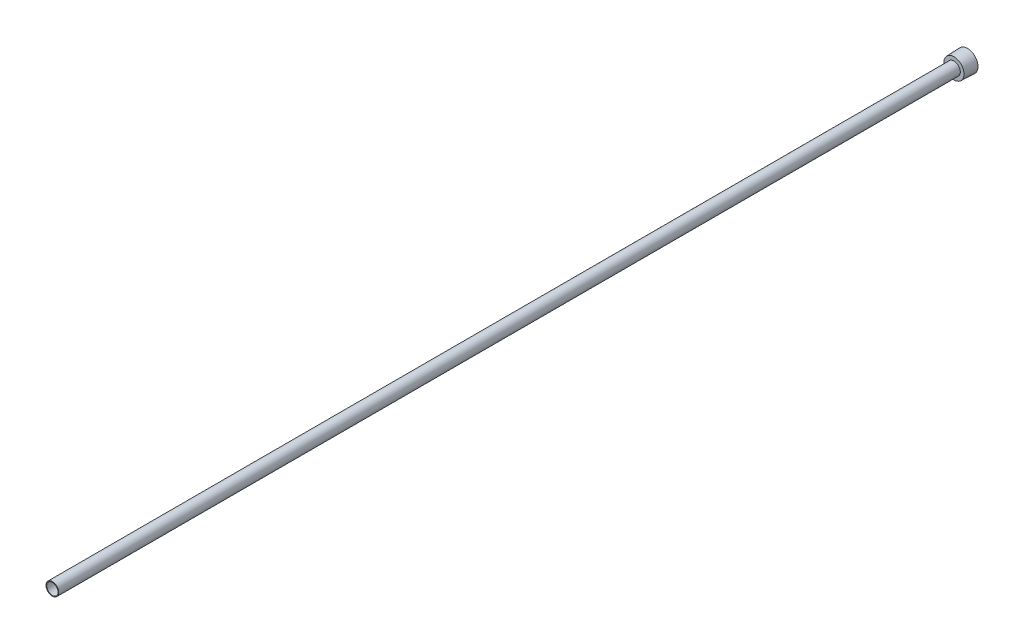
ISO-10303-21;
HEADER;
FILE_DESCRIPTION(('STEP AP214'),'2;1');
FILE_NAME('part.step','',(''),(''),'','','');
FILE_SCHEMA(('AUTOMOTIVE_DESIGN { 1 0 10303 214 1 1 1 1 }'));
ENDSEC;
DATA;
#1=APPLICATION_CONTEXT('core data for automotive mechanical design processes');
#2=APPLICATION_PROTOCOL_DEFINITION('international standard','automotive_design',2000,#1);
#3=PRODUCT_CONTEXT('',#1,'mechanical');
#4=PRODUCT('Part','Part','',(#3));
#5=PRODUCT_RELATED_PRODUCT_CATEGORY('part','',(#4));
#6=PRODUCT_DEFINITION_FORMATION('','',#4);
#7=PRODUCT_DEFINITION_CONTEXT('part definition',#1,'design');
#8=PRODUCT_DEFINITION('design','',#6,#7);
#9=PRODUCT_DEFINITION_SHAPE('','',#8);
#10=(LENGTH_UNIT() NAMED_UNIT(*) SI_UNIT(.MILLI.,.METRE.));
#11=(NAMED_UNIT(*) PLANE_ANGLE_UNIT() SI_UNIT($,.RADIAN.));
#12=(NAMED_UNIT(*) SI_UNIT($,.STERADIAN.) SOLID_ANGLE_UNIT());
#13=UNCERTAINTY_MEASURE_WITH_UNIT(LENGTH_MEASURE(1.E-05),#10,'distance_accuracy_value','');
#14=(GEOMETRIC_REPRESENTATION_CONTEXT(3) GLOBAL_UNCERTAINTY_ASSIGNED_CONTEXT((#13)) GLOBAL_UNIT_ASSIGNED_CONTEXT((#10,
#11,#12)) REPRESENTATION_CONTEXT('',''));
#15=CARTESIAN_POINT('',(0.,0.,0.));
#16=DIRECTION('',(0.,0.,1.));
#17=DIRECTION('',(1.,0.,0.));
#18=AXIS2_PLACEMENT_3D('',#15,#16,#17);
#19=CARTESIAN_POINT('',(0.,0.,0.));
#20=DIRECTION('',(0.,0.,1.));
#21=DIRECTION('',(1.,0.,0.));
#22=AXIS2_PLACEMENT_3D('',#19,#20,#21);
#23=CYLINDRICAL_SURFACE('',#22,5.6388);
#24=CARTESIAN_POINT('',(0.,0.,914.4));
#25=DIRECTION('',(0.,0.,1.));
#26=DIRECTION('',(1.,0.,0.));
#27=AXIS2_PLACEMENT_3D('',#24,#25,#26);
#28=CIRCLE('',#27,5.6388);
#29=CARTESIAN_POINT('',(5.6388,0.,914.4));
#30=VERTEX_POINT('',#29);
#31=EDGE_CURVE('E141',#30,#30,#28,.T.);
#32=ORIENTED_EDGE('',*,*,#31,.T.);
#33=EDGE_LOOP('',(#32));
#34=FACE_BOUND('',#33,.T.);
#35=CARTESIAN_POINT('',(0.,0.,9.525));
#36=DIRECTION('',(0.,0.,-1.));
#37=DIRECTION('',(-1.,0.,0.));
#38=AXIS2_PLACEMENT_3D('',#35,#36,#37);
#39=CIRCLE('',#38,5.6388);
#40=CARTESIAN_POINT('',(-5.6388,0.,9.525));
#41=VERTEX_POINT('',#40);
#42=EDGE_CURVE('E36',#41,#41,#39,.F.);
#43=ORIENTED_EDGE('',*,*,#42,.F.);
#44=EDGE_LOOP('',(#43));
#45=FACE_BOUND('',#44,.T.);
#46=ADVANCED_FACE('F32',(#34,#45),#23,.F.);
#47=CARTESIAN_POINT('',(0.,0.,0.));
#48=DIRECTION('',(0.,0.,1.));
#49=DIRECTION('',(1.,0.,0.));
#50=AXIS2_PLACEMENT_3D('',#47,#48,#49);
#51=PLANE('',#50);
#52=DIRECTION('',(-0.866025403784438,0.5,0.));
#53=VECTOR('',#52,1.);
#54=CARTESIAN_POINT('',(0.,-7.33234841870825,0.));
#55=LINE('',#54,#53);
#56=CARTESIAN_POINT('',(0.,-7.33234841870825,0.));
#57=VERTEX_POINT('',#56);
#58=CARTESIAN_POINT('',(-6.35,-3.66617420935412,0.));
#59=VERTEX_POINT('',#58);
#60=EDGE_CURVE('E123',#57,#59,#55,.T.);
#61=ORIENTED_EDGE('',*,*,#60,.F.);
#62=DIRECTION('',(-0.866025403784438,-0.5,0.));
#63=VECTOR('',#62,1.);
#64=CARTESIAN_POINT('',(6.35,-3.66617420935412,0.));
#65=LINE('',#64,#63);
#66=CARTESIAN_POINT('',(6.35,-3.66617420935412,0.));
#67=VERTEX_POINT('',#66);
#68=EDGE_CURVE('E48',#67,#57,#65,.T.);
#69=ORIENTED_EDGE('',*,*,#68,.F.);
#70=DIRECTION('',(0.,-1.,0.));
#71=VECTOR('',#70,1.);
#72=CARTESIAN_POINT('',(6.35,3.66617420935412,0.));
#73=LINE('',#72,#71);
#74=CARTESIAN_POINT('',(6.35,3.66617420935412,0.));
#75=VERTEX_POINT('',#74);
#76=EDGE_CURVE('E132',#75,#67,#73,.T.);
#77=ORIENTED_EDGE('',*,*,#76,.F.);
#78=DIRECTION('',(0.866025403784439,-0.5,0.));
#79=VECTOR('',#78,1.);
#80=CARTESIAN_POINT('',(0.,7.33234841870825,0.));
#81=LINE('',#80,#79);
#82=CARTESIAN_POINT('',(0.,7.33234841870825,0.));
#83=VERTEX_POINT('',#82);
#84=EDGE_CURVE('E130',#83,#75,#81,.T.);
#85=ORIENTED_EDGE('',*,*,#84,.F.);
#86=DIRECTION('',(0.866025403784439,0.5,0.));
#87=VECTOR('',#86,1.);
#88=CARTESIAN_POINT('',(-6.35,3.66617420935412,0.));
#89=LINE('',#88,#87);
#90=CARTESIAN_POINT('',(-6.35,3.66617420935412,0.));
#91=VERTEX_POINT('',#90);
#92=EDGE_CURVE('E96',#91,#83,#89,.T.);
#93=ORIENTED_EDGE('',*,*,#92,.F.);
#94=DIRECTION('',(0.,1.,0.));
#95=VECTOR('',#94,1.);
#96=CARTESIAN_POINT('',(-6.35,-3.66617420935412,0.));
#97=LINE('',#96,#95);
#98=EDGE_CURVE('E126',#59,#91,#97,.T.);
#99=ORIENTED_EDGE('',*,*,#98,.F.);
#100=EDGE_LOOP('',(#61,#69,#77,#85,#93,#99));
#101=FACE_BOUND('',#100,.T.);
#102=CARTESIAN_POINT('',(0.,0.,0.));
#103=DIRECTION('',(0.,0.,1.));
#104=DIRECTION('',(1.,0.,0.));
#105=AXIS2_PLACEMENT_3D('',#102,#103,#104);
#106=CIRCLE('',#105,10.541);
#107=CARTESIAN_POINT('',(10.541,0.,0.));
#108=VERTEX_POINT('',#107);
#109=EDGE_CURVE('E11',#108,#108,#106,.T.);
#110=ORIENTED_EDGE('',*,*,#109,.F.);
#111=EDGE_LOOP('',(#110));
#112=FACE_BOUND('',#111,.T.);
#113=ADVANCED_FACE('F34',(#101,#112),#51,.F.);
#114=CARTESIAN_POINT('',(0.,0.,0.));
#115=DIRECTION('',(0.,0.,-1.));
#116=DIRECTION('',(-1.,0.,0.));
#117=AXIS2_PLACEMENT_3D('',#114,#115,#116);
#118=CONICAL_SURFACE('',#117,10.541,0.0364599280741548);
#119=CARTESIAN_POINT('',(0.,0.,13.4874));
#120=DIRECTION('',(0.,0.,1.));
#121=DIRECTION('',(1.,0.,0.));
#122=AXIS2_PLACEMENT_3D('',#119,#120,#121);
#123=CIRCLE('',#122,10.0490323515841);
#124=CARTESIAN_POINT('',(10.0490323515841,0.,13.4874));
#125=VERTEX_POINT('',#124);
#126=EDGE_CURVE('E41',#125,#125,#123,.T.);
#127=ORIENTED_EDGE('',*,*,#126,.F.);
#128=EDGE_LOOP('',(#127));
#129=FACE_BOUND('',#128,.T.);
#130=ORIENTED_EDGE('',*,*,#109,.T.);
#131=EDGE_LOOP('',(#130));
#132=FACE_BOUND('',#131,.T.);
#133=ADVANCED_FACE('F155',(#129,#132),#118,.T.);
#134=CARTESIAN_POINT('',(0.,10.0490323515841,13.4874));
#135=DIRECTION('',(0.,0.,-1.));
#136=DIRECTION('',(-1.,0.,0.));
#137=AXIS2_PLACEMENT_3D('',#134,#135,#136);
#138=PLANE('',#137);
#139=CARTESIAN_POINT('',(0.,0.,13.4874));
#140=DIRECTION('',(0.,0.,1.));
#141=DIRECTION('',(1.,0.,0.));
#142=AXIS2_PLACEMENT_3D('',#139,#140,#141);
#143=CIRCLE('',#142,6.35);
#144=CARTESIAN_POINT('',(6.35,0.,13.4874));
#145=VERTEX_POINT('',#144);
#146=EDGE_CURVE('E147',#145,#145,#143,.T.);
#147=ORIENTED_EDGE('',*,*,#146,.F.);
#148=EDGE_LOOP('',(#147));
#149=FACE_BOUND('',#148,.T.);
#150=ORIENTED_EDGE('',*,*,#126,.T.);
#151=EDGE_LOOP('',(#150));
#152=FACE_BOUND('',#151,.T.);
#153=ADVANCED_FACE('F153',(#149,#152),#138,.F.);
#154=CARTESIAN_POINT('',(0.,0.,223.212151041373));
#155=DIRECTION('',(0.,0.,1.));
#156=DIRECTION('',(1.,0.,0.));
#157=AXIS2_PLACEMENT_3D('',#154,#155,#156);
#158=CYLINDRICAL_SURFACE('',#157,6.34999999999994);
#159=CARTESIAN_POINT('',(0.,0.,914.4));
#160=DIRECTION('',(0.,0.,1.));
#161=DIRECTION('',(1.,0.,0.));
#162=AXIS2_PLACEMENT_3D('',#159,#160,#161);
#163=CIRCLE('',#162,6.34999999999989);
#164=CARTESIAN_POINT('',(6.34999999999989,0.,914.4));
#165=VERTEX_POINT('',#164);
#166=EDGE_CURVE('E144',#165,#165,#163,.T.);
#167=ORIENTED_EDGE('',*,*,#166,.F.);
#168=EDGE_LOOP('',(#167));
#169=FACE_BOUND('',#168,.T.);
#170=ORIENTED_EDGE('',*,*,#146,.T.);
#171=EDGE_LOOP('',(#170));
#172=FACE_BOUND('',#171,.T.);
#173=ADVANCED_FACE('F189',(#169,#172),#158,.T.);
#174=CARTESIAN_POINT('',(0.,6.34999999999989,914.4));
#175=DIRECTION('',(0.,0.,-1.));
#176=DIRECTION('',(-1.,0.,0.));
#177=AXIS2_PLACEMENT_3D('',#174,#175,#176);
#178=PLANE('',#177);
#179=ORIENTED_EDGE('',*,*,#31,.F.);
#180=EDGE_LOOP('',(#179));
#181=FACE_BOUND('',#180,.T.);
#182=ORIENTED_EDGE('',*,*,#166,.T.);
#183=EDGE_LOOP('',(#182));
#184=FACE_BOUND('',#183,.T.);
#185=ADVANCED_FACE('F182',(#181,#184),#178,.F.);
#186=CARTESIAN_POINT('',(0.,-7.33234841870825,9.525));
#187=DIRECTION('',(0.,0.,-1.));
#188=DIRECTION('',(-1.,0.,0.));
#189=AXIS2_PLACEMENT_3D('',#186,#187,#188);
#190=PLANE('',#189);
#191=DIRECTION('',(-0.866025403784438,-0.5,0.));
#192=VECTOR('',#191,1.);
#193=CARTESIAN_POINT('',(6.35,-3.66617420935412,9.525));
#194=LINE('',#193,#192);
#195=CARTESIAN_POINT('',(6.35,-3.66617420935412,9.525));
#196=VERTEX_POINT('',#195);
#197=CARTESIAN_POINT('',(0.,-7.33234841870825,9.525));
#198=VERTEX_POINT('',#197);
#199=EDGE_CURVE('E134',#196,#198,#194,.T.);
#200=ORIENTED_EDGE('',*,*,#199,.T.);
#201=DIRECTION('',(-0.866025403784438,0.5,0.));
#202=VECTOR('',#201,1.);
#203=CARTESIAN_POINT('',(0.,-7.33234841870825,9.525));
#204=LINE('',#203,#202);
#205=CARTESIAN_POINT('',(-6.35,-3.66617420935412,9.525));
#206=VERTEX_POINT('',#205);
#207=EDGE_CURVE('E117',#198,#206,#204,.T.);
#208=ORIENTED_EDGE('',*,*,#207,.T.);
#209=DIRECTION('',(0.,1.,0.));
#210=VECTOR('',#209,1.);
#211=CARTESIAN_POINT('',(-6.35,-3.66617420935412,9.525));
#212=LINE('',#211,#210);
#213=CARTESIAN_POINT('',(-6.35,3.66617420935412,9.525));
#214=VERTEX_POINT('',#213);
#215=EDGE_CURVE('E115',#206,#214,#212,.T.);
#216=ORIENTED_EDGE('',*,*,#215,.T.);
#217=DIRECTION('',(0.866025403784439,0.5,0.));
#218=VECTOR('',#217,1.);
#219=CARTESIAN_POINT('',(-6.35,3.66617420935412,9.525));
#220=LINE('',#219,#218);
#221=CARTESIAN_POINT('',(0.,7.33234841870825,9.525));
#222=VERTEX_POINT('',#221);
#223=EDGE_CURVE('E93',#214,#222,#220,.T.);
#224=ORIENTED_EDGE('',*,*,#223,.T.);
#225=DIRECTION('',(0.866025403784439,-0.5,0.));
#226=VECTOR('',#225,1.);
#227=CARTESIAN_POINT('',(0.,7.33234841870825,9.525));
#228=LINE('',#227,#226);
#229=CARTESIAN_POINT('',(6.35,3.66617420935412,9.525));
#230=VERTEX_POINT('',#229);
#231=EDGE_CURVE('E104',#222,#230,#228,.T.);
#232=ORIENTED_EDGE('',*,*,#231,.T.);
#233=DIRECTION('',(0.,-1.,0.));
#234=VECTOR('',#233,1.);
#235=CARTESIAN_POINT('',(6.35,3.66617420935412,9.525));
#236=LINE('',#235,#234);
#237=EDGE_CURVE('E108',#230,#196,#236,.T.);
#238=ORIENTED_EDGE('',*,*,#237,.T.);
#239=EDGE_LOOP('',(#200,#208,#216,#224,#232,#238));
#240=FACE_BOUND('',#239,.T.);
#241=ORIENTED_EDGE('',*,*,#42,.T.);
#242=EDGE_LOOP('',(#241));
#243=FACE_BOUND('',#242,.T.);
#244=ADVANCED_FACE('F111',(#240,#243),#190,.T.);
#245=CARTESIAN_POINT('',(6.35,-3.66617420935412,9.525));
#246=DIRECTION('',(0.5,-0.866025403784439,0.));
#247=DIRECTION('',(0.866025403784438,0.5,0.));
#248=AXIS2_PLACEMENT_3D('',#245,#246,#247);
#249=PLANE('',#248);
#250=ORIENTED_EDGE('',*,*,#68,.T.);
#251=DIRECTION('',(0.,0.,-1.));
#252=VECTOR('',#251,1.);
#253=CARTESIAN_POINT('',(0.,-7.33234841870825,9.525));
#254=LINE('',#253,#252);
#255=EDGE_CURVE('E78',#198,#57,#254,.T.);
#256=ORIENTED_EDGE('',*,*,#255,.F.);
#257=ORIENTED_EDGE('',*,*,#199,.F.);
#258=DIRECTION('',(0.,0.,-1.));
#259=VECTOR('',#258,1.);
#260=CARTESIAN_POINT('',(6.35,-3.66617420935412,9.525));
#261=LINE('',#260,#259);
#262=EDGE_CURVE('E56',#196,#67,#261,.T.);
#263=ORIENTED_EDGE('',*,*,#262,.T.);
#264=EDGE_LOOP('',(#250,#256,#257,#263));
#265=FACE_BOUND('',#264,.T.);
#266=ADVANCED_FACE('F173',(#265),#249,.F.);
#267=CARTESIAN_POINT('',(6.35,3.66617420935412,9.525));
#268=DIRECTION('',(1.,0.,0.));
#269=DIRECTION('',(0.,0.,-1.));
#270=AXIS2_PLACEMENT_3D('',#267,#268,#269);
#271=PLANE('',#270);
#272=ORIENTED_EDGE('',*,*,#76,.T.);
#273=ORIENTED_EDGE('',*,*,#262,.F.);
#274=ORIENTED_EDGE('',*,*,#237,.F.);
#275=DIRECTION('',(0.,0.,-1.));
#276=VECTOR('',#275,1.);
#277=CARTESIAN_POINT('',(6.35,3.66617420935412,9.525));
#278=LINE('',#277,#276);
#279=EDGE_CURVE('E100',#230,#75,#278,.T.);
#280=ORIENTED_EDGE('',*,*,#279,.T.);
#281=EDGE_LOOP('',(#272,#273,#274,#280));
#282=FACE_BOUND('',#281,.T.);
#283=ADVANCED_FACE('F175',(#282),#271,.F.);
#284=CARTESIAN_POINT('',(0.,7.33234841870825,9.525));
#285=DIRECTION('',(0.5,0.866025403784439,0.));
#286=DIRECTION('',(-0.866025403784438,0.5,0.));
#287=AXIS2_PLACEMENT_3D('',#284,#285,#286);
#288=PLANE('',#287);
#289=ORIENTED_EDGE('',*,*,#84,.T.);
#290=ORIENTED_EDGE('',*,*,#279,.F.);
#291=ORIENTED_EDGE('',*,*,#231,.F.);
#292=DIRECTION('',(0.,0.,-1.));
#293=VECTOR('',#292,1.);
#294=CARTESIAN_POINT('',(0.,7.33234841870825,9.525));
#295=LINE('',#294,#293);
#296=EDGE_CURVE('E89',#222,#83,#295,.T.);
#297=ORIENTED_EDGE('',*,*,#296,.T.);
#298=EDGE_LOOP('',(#289,#290,#291,#297));
#299=FACE_BOUND('',#298,.T.);
#300=ADVANCED_FACE('F105',(#299),#288,.F.);
#301=CARTESIAN_POINT('',(-6.35,3.66617420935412,9.525));
#302=DIRECTION('',(-0.5,0.866025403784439,0.));
#303=DIRECTION('',(-0.866025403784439,-0.5,0.));
#304=AXIS2_PLACEMENT_3D('',#301,#302,#303);
#305=PLANE('',#304);
#306=ORIENTED_EDGE('',*,*,#92,.T.);
#307=ORIENTED_EDGE('',*,*,#296,.F.);
#308=ORIENTED_EDGE('',*,*,#223,.F.);
#309=DIRECTION('',(0.,0.,-1.));
#310=VECTOR('',#309,1.);
#311=CARTESIAN_POINT('',(-6.35,3.66617420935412,9.525));
#312=LINE('',#311,#310);
#313=EDGE_CURVE('E101',#214,#91,#312,.T.);
#314=ORIENTED_EDGE('',*,*,#313,.T.);
#315=EDGE_LOOP('',(#306,#307,#308,#314));
#316=FACE_BOUND('',#315,.T.);
#317=ADVANCED_FACE('F91',(#316),#305,.F.);
#318=CARTESIAN_POINT('',(-6.35,-3.66617420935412,9.525));
#319=DIRECTION('',(-1.,0.,0.));
#320=DIRECTION('',(0.,-1.,0.));
#321=AXIS2_PLACEMENT_3D('',#318,#319,#320);
#322=PLANE('',#321);
#323=ORIENTED_EDGE('',*,*,#98,.T.);
#324=ORIENTED_EDGE('',*,*,#313,.F.);
#325=ORIENTED_EDGE('',*,*,#215,.F.);
#326=DIRECTION('',(0.,0.,-1.));
#327=VECTOR('',#326,1.);
#328=CARTESIAN_POINT('',(-6.35,-3.66617420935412,9.525));
#329=LINE('',#328,#327);
#330=EDGE_CURVE('E138',#206,#59,#329,.T.);
#331=ORIENTED_EDGE('',*,*,#330,.T.);
#332=EDGE_LOOP('',(#323,#324,#325,#331));
#333=FACE_BOUND('',#332,.T.);
#334=ADVANCED_FACE('F245',(#333),#322,.F.);
#335=CARTESIAN_POINT('',(0.,-7.33234841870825,9.525));
#336=DIRECTION('',(-0.5,-0.866025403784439,0.));
#337=DIRECTION('',(0.866025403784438,-0.5,0.));
#338=AXIS2_PLACEMENT_3D('',#335,#336,#337);
#339=PLANE('',#338);
#340=ORIENTED_EDGE('',*,*,#60,.T.);
#341=ORIENTED_EDGE('',*,*,#330,.F.);
#342=ORIENTED_EDGE('',*,*,#207,.F.);
#343=ORIENTED_EDGE('',*,*,#255,.T.);
#344=EDGE_LOOP('',(#340,#341,#342,#343));
#345=FACE_BOUND('',#344,.T.);
#346=ADVANCED_FACE('F171',(#345),#339,.F.);
#347=CLOSED_SHELL('',(#46,#113,#133,#153,#173,#185,#244,#266,#283,#300,#317,#334,#346));
#348=MANIFOLD_SOLID_BREP('B2',#347);
#349=ADVANCED_BREP_SHAPE_REPRESENTATION('',(#18,#348),#14);
#350=SHAPE_DEFINITION_REPRESENTATION(#9,#349);
ENDSEC;
END-ISO-10303-21;
